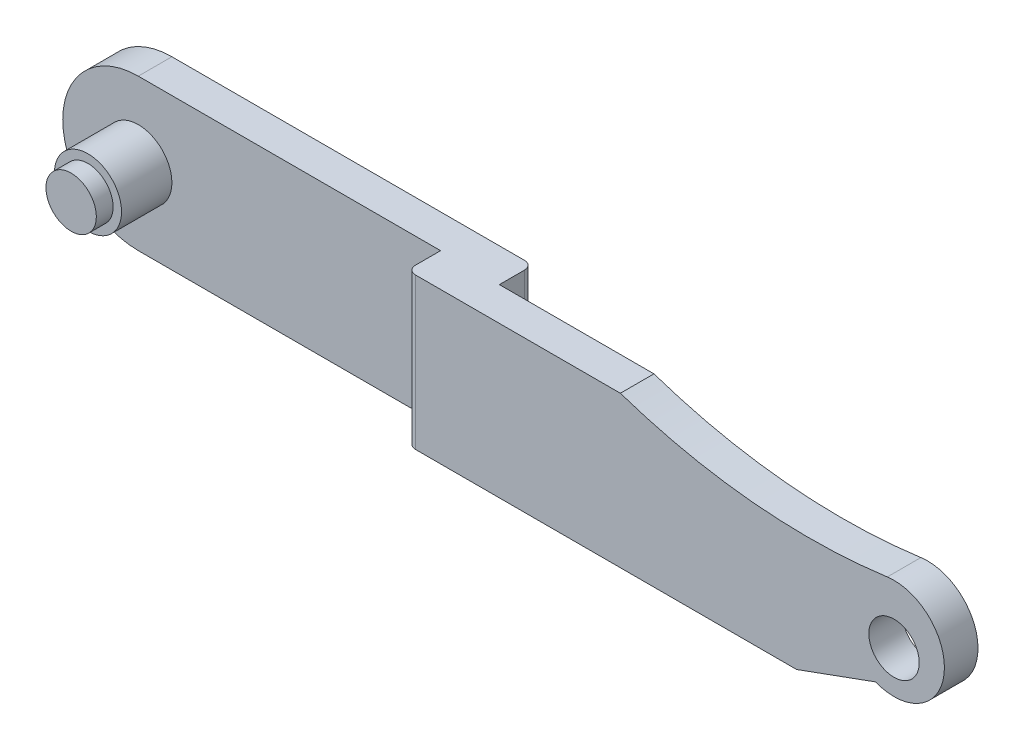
ISO-10303-21;
HEADER;
FILE_DESCRIPTION(('STEP AP214'),'2;1');
FILE_NAME('part.step','',(''),(''),'','','');
FILE_SCHEMA(('AUTOMOTIVE_DESIGN { 1 0 10303 214 1 1 1 1 }'));
ENDSEC;
DATA;
#1=APPLICATION_CONTEXT('core data for automotive mechanical design processes');
#2=APPLICATION_PROTOCOL_DEFINITION('international standard','automotive_design',2000,#1);
#3=PRODUCT_CONTEXT('',#1,'mechanical');
#4=PRODUCT('Part','Part','',(#3));
#5=PRODUCT_RELATED_PRODUCT_CATEGORY('part','',(#4));
#6=PRODUCT_DEFINITION_FORMATION('','',#4);
#7=PRODUCT_DEFINITION_CONTEXT('part definition',#1,'design');
#8=PRODUCT_DEFINITION('design','',#6,#7);
#9=PRODUCT_DEFINITION_SHAPE('','',#8);
#10=(LENGTH_UNIT() NAMED_UNIT(*) SI_UNIT(.MILLI.,.METRE.));
#11=(NAMED_UNIT(*) PLANE_ANGLE_UNIT() SI_UNIT($,.RADIAN.));
#12=(NAMED_UNIT(*) SI_UNIT($,.STERADIAN.) SOLID_ANGLE_UNIT());
#13=UNCERTAINTY_MEASURE_WITH_UNIT(LENGTH_MEASURE(1.E-05),#10,'distance_accuracy_value','');
#14=(GEOMETRIC_REPRESENTATION_CONTEXT(3) GLOBAL_UNCERTAINTY_ASSIGNED_CONTEXT((#13)) GLOBAL_UNIT_ASSIGNED_CONTEXT((#10,
#11,#12)) REPRESENTATION_CONTEXT('',''));
#15=CARTESIAN_POINT('',(0.,0.,0.));
#16=DIRECTION('',(0.,0.,1.));
#17=DIRECTION('',(1.,0.,0.));
#18=AXIS2_PLACEMENT_3D('',#15,#16,#17);
#19=CARTESIAN_POINT('',(0.,-4.5,-2.));
#20=DIRECTION('',(0.,0.,-1.));
#21=DIRECTION('',(-1.,0.,0.));
#22=AXIS2_PLACEMENT_3D('',#19,#20,#21);
#23=PLANE('',#22);
#24=CARTESIAN_POINT('',(0.,-4.5,-2.));
#25=DIRECTION('',(0.,0.,-1.));
#26=DIRECTION('',(-1.,0.,0.));
#27=AXIS2_PLACEMENT_3D('',#24,#25,#26);
#28=CIRCLE('',#27,2.);
#29=CARTESIAN_POINT('',(-2.,-4.5,-2.));
#30=VERTEX_POINT('',#29);
#31=EDGE_CURVE('E495',#30,#30,#28,.T.);
#32=ORIENTED_EDGE('',*,*,#31,.T.);
#33=EDGE_LOOP('',(#32));
#34=FACE_BOUND('',#33,.T.);
#35=CARTESIAN_POINT('',(0.,-4.5,-2.));
#36=DIRECTION('',(0.,0.,-1.));
#37=DIRECTION('',(-1.,0.,0.));
#38=AXIS2_PLACEMENT_3D('',#35,#36,#37);
#39=CIRCLE('',#38,1.5);
#40=CARTESIAN_POINT('',(-1.5,-4.5,-2.));
#41=VERTEX_POINT('',#40);
#42=EDGE_CURVE('E496',#41,#41,#39,.T.);
#43=ORIENTED_EDGE('',*,*,#42,.F.);
#44=EDGE_LOOP('',(#43));
#45=FACE_BOUND('',#44,.T.);
#46=ADVANCED_FACE('F34',(#34,#45),#23,.T.);
#47=CARTESIAN_POINT('',(0.,-4.5,0.));
#48=DIRECTION('',(0.,0.,1.));
#49=DIRECTION('',(1.,0.,0.));
#50=AXIS2_PLACEMENT_3D('',#47,#48,#49);
#51=PLANE('',#50);
#52=DIRECTION('',(-1.,0.,0.));
#53=VECTOR('',#52,1.);
#54=CARTESIAN_POINT('',(0.,0.,0.));
#55=LINE('',#54,#53);
#56=CARTESIAN_POINT('',(21.,0.,0.));
#57=VERTEX_POINT('',#56);
#58=CARTESIAN_POINT('',(0.,0.,0.));
#59=VERTEX_POINT('',#58);
#60=EDGE_CURVE('E175',#57,#59,#55,.T.);
#61=ORIENTED_EDGE('',*,*,#60,.F.);
#62=DIRECTION('',(0.,1.,0.));
#63=VECTOR('',#62,1.);
#64=CARTESIAN_POINT('',(21.,-4.5,0.));
#65=LINE('',#64,#63);
#66=CARTESIAN_POINT('',(21.,-9.,0.));
#67=VERTEX_POINT('',#66);
#68=EDGE_CURVE('E218',#57,#67,#65,.F.);
#69=ORIENTED_EDGE('',*,*,#68,.T.);
#70=DIRECTION('',(1.,0.,0.));
#71=VECTOR('',#70,1.);
#72=CARTESIAN_POINT('',(21.5,-9.,0.));
#73=LINE('',#72,#71);
#74=CARTESIAN_POINT('',(0.,-9.,0.));
#75=VERTEX_POINT('',#74);
#76=EDGE_CURVE('E173',#75,#67,#73,.T.);
#77=ORIENTED_EDGE('',*,*,#76,.F.);
#78=CARTESIAN_POINT('',(0.,-4.5,0.));
#79=DIRECTION('',(0.,0.,1.));
#80=DIRECTION('',(1.,0.,0.));
#81=AXIS2_PLACEMENT_3D('',#78,#79,#80);
#82=CIRCLE('',#81,4.5);
#83=EDGE_CURVE('E128',#59,#75,#82,.T.);
#84=ORIENTED_EDGE('',*,*,#83,.F.);
#85=EDGE_LOOP('',(#61,#69,#77,#84));
#86=FACE_BOUND('',#85,.T.);
#87=CARTESIAN_POINT('',(0.,-4.5,0.));
#88=DIRECTION('',(0.,0.,1.));
#89=DIRECTION('',(1.,0.,0.));
#90=AXIS2_PLACEMENT_3D('',#87,#88,#89);
#91=CIRCLE('',#90,2.);
#92=CARTESIAN_POINT('',(2.,-4.5,0.));
#93=VERTEX_POINT('',#92);
#94=EDGE_CURVE('E205',#93,#93,#91,.F.);
#95=ORIENTED_EDGE('',*,*,#94,.F.);
#96=EDGE_LOOP('',(#95));
#97=FACE_BOUND('',#96,.T.);
#98=ADVANCED_FACE('F279',(#86,#97),#51,.F.);
#99=CARTESIAN_POINT('',(0.,-4.5,5.));
#100=DIRECTION('',(0.,0.,1.));
#101=DIRECTION('',(1.,0.,0.));
#102=AXIS2_PLACEMENT_3D('',#99,#100,#101);
#103=PLANE('',#102);
#104=CARTESIAN_POINT('',(0.,-4.5,5.));
#105=DIRECTION('',(0.,0.,1.));
#106=DIRECTION('',(1.,0.,0.));
#107=AXIS2_PLACEMENT_3D('',#104,#105,#106);
#108=CIRCLE('',#107,2.);
#109=CARTESIAN_POINT('',(2.,-4.5,5.));
#110=VERTEX_POINT('',#109);
#111=EDGE_CURVE('E511',#110,#110,#108,.T.);
#112=ORIENTED_EDGE('',*,*,#111,.T.);
#113=EDGE_LOOP('',(#112));
#114=FACE_BOUND('',#113,.T.);
#115=CARTESIAN_POINT('',(0.,-4.5,5.));
#116=DIRECTION('',(0.,0.,1.));
#117=DIRECTION('',(1.,0.,0.));
#118=AXIS2_PLACEMENT_3D('',#115,#116,#117);
#119=CIRCLE('',#118,1.5);
#120=CARTESIAN_POINT('',(1.5,-4.5,5.));
#121=VERTEX_POINT('',#120);
#122=EDGE_CURVE('E498',#121,#121,#119,.T.);
#123=ORIENTED_EDGE('',*,*,#122,.F.);
#124=EDGE_LOOP('',(#123));
#125=FACE_BOUND('',#124,.T.);
#126=ADVANCED_FACE('F286',(#114,#125),#103,.T.);
#127=CARTESIAN_POINT('',(0.,-4.5,2.));
#128=DIRECTION('',(0.,0.,1.));
#129=DIRECTION('',(1.,0.,0.));
#130=AXIS2_PLACEMENT_3D('',#127,#128,#129);
#131=PLANE('',#130);
#132=DIRECTION('',(0.,-1.,0.));
#133=VECTOR('',#132,1.);
#134=CARTESIAN_POINT('',(18.,0.,2.));
#135=LINE('',#134,#133);
#136=CARTESIAN_POINT('',(18.,0.,2.));
#137=VERTEX_POINT('',#136);
#138=CARTESIAN_POINT('',(18.,-9.,2.));
#139=VERTEX_POINT('',#138);
#140=EDGE_CURVE('E135',#137,#139,#135,.T.);
#141=ORIENTED_EDGE('',*,*,#140,.F.);
#142=DIRECTION('',(-1.,0.,0.));
#143=VECTOR('',#142,1.);
#144=CARTESIAN_POINT('',(0.,0.,2.));
#145=LINE('',#144,#143);
#146=CARTESIAN_POINT('',(0.,0.,2.));
#147=VERTEX_POINT('',#146);
#148=EDGE_CURVE('E185',#137,#147,#145,.T.);
#149=ORIENTED_EDGE('',*,*,#148,.T.);
#150=CARTESIAN_POINT('',(0.,-4.5,2.));
#151=DIRECTION('',(0.,0.,1.));
#152=DIRECTION('',(1.,0.,0.));
#153=AXIS2_PLACEMENT_3D('',#150,#151,#152);
#154=CIRCLE('',#153,4.5);
#155=CARTESIAN_POINT('',(0.,-9.,2.));
#156=VERTEX_POINT('',#155);
#157=EDGE_CURVE('E138',#147,#156,#154,.T.);
#158=ORIENTED_EDGE('',*,*,#157,.T.);
#159=DIRECTION('',(1.,0.,0.));
#160=VECTOR('',#159,1.);
#161=CARTESIAN_POINT('',(21.5,-9.,2.));
#162=LINE('',#161,#160);
#163=EDGE_CURVE('E124',#156,#139,#162,.T.);
#164=ORIENTED_EDGE('',*,*,#163,.T.);
#165=EDGE_LOOP('',(#141,#149,#158,#164));
#166=FACE_BOUND('',#165,.T.);
#167=CARTESIAN_POINT('',(0.,-4.5,2.));
#168=DIRECTION('',(0.,0.,1.));
#169=DIRECTION('',(1.,0.,0.));
#170=AXIS2_PLACEMENT_3D('',#167,#168,#169);
#171=CIRCLE('',#170,2.);
#172=CARTESIAN_POINT('',(2.,-4.5,2.));
#173=VERTEX_POINT('',#172);
#174=EDGE_CURVE('E508',#173,#173,#171,.T.);
#175=ORIENTED_EDGE('',*,*,#174,.F.);
#176=EDGE_LOOP('',(#175));
#177=FACE_BOUND('',#176,.T.);
#178=ADVANCED_FACE('F133',(#166,#177),#131,.T.);
#179=CARTESIAN_POINT('',(0.,-4.5,2.));
#180=DIRECTION('',(0.,0.,-1.));
#181=DIRECTION('',(-1.,0.,0.));
#182=AXIS2_PLACEMENT_3D('',#179,#180,#181);
#183=CYLINDRICAL_SURFACE('',#182,4.5);
#184=ORIENTED_EDGE('',*,*,#83,.T.);
#185=DIRECTION('',(0.,0.,-1.));
#186=VECTOR('',#185,1.);
#187=CARTESIAN_POINT('',(0.,-9.,2.));
#188=LINE('',#187,#186);
#189=EDGE_CURVE('E183',#156,#75,#188,.T.);
#190=ORIENTED_EDGE('',*,*,#189,.F.);
#191=ORIENTED_EDGE('',*,*,#157,.F.);
#192=DIRECTION('',(0.,0.,-1.));
#193=VECTOR('',#192,1.);
#194=CARTESIAN_POINT('',(0.,0.,2.));
#195=LINE('',#194,#193);
#196=EDGE_CURVE('E186',#147,#59,#195,.T.);
#197=ORIENTED_EDGE('',*,*,#196,.T.);
#198=EDGE_LOOP('',(#184,#190,#191,#197));
#199=FACE_BOUND('',#198,.T.);
#200=ADVANCED_FACE('F36',(#199),#183,.T.);
#201=CARTESIAN_POINT('',(21.5,-9.,2.));
#202=DIRECTION('',(0.,1.,0.));
#203=DIRECTION('',(-1.,0.,0.));
#204=AXIS2_PLACEMENT_3D('',#201,#202,#203);
#205=PLANE('',#204);
#206=ORIENTED_EDGE('',*,*,#76,.T.);
#207=CARTESIAN_POINT('',(21.,-9.,0.5));
#208=DIRECTION('',(0.,1.,0.));
#209=DIRECTION('',(-1.,0.,0.));
#210=AXIS2_PLACEMENT_3D('',#207,#208,#209);
#211=CIRCLE('',#210,0.5);
#212=CARTESIAN_POINT('',(21.5,-9.,0.5));
#213=VERTEX_POINT('',#212);
#214=EDGE_CURVE('E221',#67,#213,#211,.F.);
#215=ORIENTED_EDGE('',*,*,#214,.T.);
#216=DIRECTION('',(0.,0.,-1.));
#217=VECTOR('',#216,1.);
#218=CARTESIAN_POINT('',(21.5,-9.,2.));
#219=LINE('',#218,#217);
#220=CARTESIAN_POINT('',(21.5,-9.,2.));
#221=VERTEX_POINT('',#220);
#222=EDGE_CURVE('E194',#221,#213,#219,.T.);
#223=ORIENTED_EDGE('',*,*,#222,.F.);
#224=DIRECTION('',(1.,0.,0.));
#225=VECTOR('',#224,1.);
#226=CARTESIAN_POINT('',(41.2,-9.,2.));
#227=LINE('',#226,#225);
#228=CARTESIAN_POINT('',(41.2,-9.,2.));
#229=VERTEX_POINT('',#228);
#230=EDGE_CURVE('E145',#221,#229,#227,.T.);
#231=ORIENTED_EDGE('',*,*,#230,.T.);
#232=DIRECTION('',(0.,0.,-1.));
#233=VECTOR('',#232,1.);
#234=CARTESIAN_POINT('',(41.2,-9.,4.));
#235=LINE('',#234,#233);
#236=CARTESIAN_POINT('',(41.2,-9.,4.));
#237=VERTEX_POINT('',#236);
#238=EDGE_CURVE('E129',#237,#229,#235,.T.);
#239=ORIENTED_EDGE('',*,*,#238,.F.);
#240=DIRECTION('',(1.,0.,0.));
#241=VECTOR('',#240,1.);
#242=CARTESIAN_POINT('',(41.2,-9.,4.));
#243=LINE('',#242,#241);
#244=CARTESIAN_POINT('',(18.5,-9.,4.));
#245=VERTEX_POINT('',#244);
#246=EDGE_CURVE('E225',#245,#237,#243,.T.);
#247=ORIENTED_EDGE('',*,*,#246,.F.);
#248=CARTESIAN_POINT('',(18.5,-9.,3.5));
#249=DIRECTION('',(0.,1.,0.));
#250=DIRECTION('',(-1.,0.,0.));
#251=AXIS2_PLACEMENT_3D('',#248,#249,#250);
#252=CIRCLE('',#251,0.5);
#253=CARTESIAN_POINT('',(18.,-9.,3.5));
#254=VERTEX_POINT('',#253);
#255=EDGE_CURVE('E49',#245,#254,#252,.F.);
#256=ORIENTED_EDGE('',*,*,#255,.T.);
#257=DIRECTION('',(0.,0.,-1.));
#258=VECTOR('',#257,1.);
#259=CARTESIAN_POINT('',(18.,-9.,4.));
#260=LINE('',#259,#258);
#261=EDGE_CURVE('E119',#254,#139,#260,.T.);
#262=ORIENTED_EDGE('',*,*,#261,.T.);
#263=ORIENTED_EDGE('',*,*,#163,.F.);
#264=ORIENTED_EDGE('',*,*,#189,.T.);
#265=EDGE_LOOP('',(#206,#215,#223,#231,#239,#247,#256,#262,#263,#264));
#266=FACE_BOUND('',#265,.T.);
#267=ADVANCED_FACE('F122',(#266),#205,.F.);
#268=CARTESIAN_POINT('',(21.5,0.,2.));
#269=DIRECTION('',(-1.,0.,0.));
#270=DIRECTION('',(0.,0.,1.));
#271=AXIS2_PLACEMENT_3D('',#268,#269,#270);
#272=PLANE('',#271);
#273=ORIENTED_EDGE('',*,*,#222,.T.);
#274=DIRECTION('',(0.,1.,0.));
#275=VECTOR('',#274,1.);
#276=CARTESIAN_POINT('',(21.5,0.,0.5));
#277=LINE('',#276,#275);
#278=CARTESIAN_POINT('',(21.5,0.,0.5));
#279=VERTEX_POINT('',#278);
#280=EDGE_CURVE('E208',#213,#279,#277,.T.);
#281=ORIENTED_EDGE('',*,*,#280,.T.);
#282=DIRECTION('',(0.,0.,-1.));
#283=VECTOR('',#282,1.);
#284=CARTESIAN_POINT('',(21.5,0.,2.));
#285=LINE('',#284,#283);
#286=CARTESIAN_POINT('',(21.5,0.,2.));
#287=VERTEX_POINT('',#286);
#288=EDGE_CURVE('E189',#287,#279,#285,.T.);
#289=ORIENTED_EDGE('',*,*,#288,.F.);
#290=DIRECTION('',(0.,1.,0.));
#291=VECTOR('',#290,1.);
#292=CARTESIAN_POINT('',(21.5,0.,2.));
#293=LINE('',#292,#291);
#294=EDGE_CURVE('E140',#221,#287,#293,.T.);
#295=ORIENTED_EDGE('',*,*,#294,.F.);
#296=EDGE_LOOP('',(#273,#281,#289,#295));
#297=FACE_BOUND('',#296,.T.);
#298=ADVANCED_FACE('F271',(#297),#272,.F.);
#299=CARTESIAN_POINT('',(0.,0.,2.));
#300=DIRECTION('',(0.,-1.,0.));
#301=DIRECTION('',(0.,0.,-1.));
#302=AXIS2_PLACEMENT_3D('',#299,#300,#301);
#303=PLANE('',#302);
#304=ORIENTED_EDGE('',*,*,#288,.T.);
#305=CARTESIAN_POINT('',(21.,0.,0.5));
#306=DIRECTION('',(0.,-1.,0.));
#307=DIRECTION('',(0.,0.,-1.));
#308=AXIS2_PLACEMENT_3D('',#305,#306,#307);
#309=CIRCLE('',#308,0.5);
#310=EDGE_CURVE('E216',#279,#57,#309,.F.);
#311=ORIENTED_EDGE('',*,*,#310,.T.);
#312=ORIENTED_EDGE('',*,*,#60,.T.);
#313=ORIENTED_EDGE('',*,*,#196,.F.);
#314=ORIENTED_EDGE('',*,*,#148,.F.);
#315=DIRECTION('',(0.,0.,-1.));
#316=VECTOR('',#315,1.);
#317=CARTESIAN_POINT('',(18.,0.,4.));
#318=LINE('',#317,#316);
#319=CARTESIAN_POINT('',(18.,0.,3.5));
#320=VERTEX_POINT('',#319);
#321=EDGE_CURVE('E144',#320,#137,#318,.T.);
#322=ORIENTED_EDGE('',*,*,#321,.F.);
#323=CARTESIAN_POINT('',(18.5,0.,3.5));
#324=DIRECTION('',(0.,-1.,0.));
#325=DIRECTION('',(0.,0.,-1.));
#326=AXIS2_PLACEMENT_3D('',#323,#324,#325);
#327=CIRCLE('',#326,0.5);
#328=CARTESIAN_POINT('',(18.5,0.,4.));
#329=VERTEX_POINT('',#328);
#330=EDGE_CURVE('E211',#320,#329,#327,.F.);
#331=ORIENTED_EDGE('',*,*,#330,.T.);
#332=DIRECTION('',(-1.,0.,0.));
#333=VECTOR('',#332,1.);
#334=CARTESIAN_POINT('',(18.,0.,4.));
#335=LINE('',#334,#333);
#336=CARTESIAN_POINT('',(30.7039235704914,0.,4.));
#337=VERTEX_POINT('',#336);
#338=EDGE_CURVE('E214',#337,#329,#335,.T.);
#339=ORIENTED_EDGE('',*,*,#338,.F.);
#340=DIRECTION('',(0.,0.,-1.));
#341=VECTOR('',#340,1.);
#342=CARTESIAN_POINT('',(30.7039235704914,0.,4.));
#343=LINE('',#342,#341);
#344=CARTESIAN_POINT('',(30.7039235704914,0.,2.));
#345=VERTEX_POINT('',#344);
#346=EDGE_CURVE('E213',#337,#345,#343,.T.);
#347=ORIENTED_EDGE('',*,*,#346,.T.);
#348=DIRECTION('',(-1.,0.,0.));
#349=VECTOR('',#348,1.);
#350=CARTESIAN_POINT('',(18.,0.,2.));
#351=LINE('',#350,#349);
#352=EDGE_CURVE('E168',#345,#287,#351,.T.);
#353=ORIENTED_EDGE('',*,*,#352,.T.);
#354=EDGE_LOOP('',(#304,#311,#312,#313,#314,#322,#331,#339,#347,#353));
#355=FACE_BOUND('',#354,.T.);
#356=ADVANCED_FACE('F268',(#355),#303,.F.);
#357=CARTESIAN_POINT('',(47.,-4.5,2.));
#358=DIRECTION('',(0.,0.,1.));
#359=DIRECTION('',(1.,0.,0.));
#360=AXIS2_PLACEMENT_3D('',#357,#358,#359);
#361=PLANE('',#360);
#362=CARTESIAN_POINT('',(47.,-4.99999999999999,2.));
#363=DIRECTION('',(0.,0.,1.));
#364=DIRECTION('',(1.,0.,0.));
#365=AXIS2_PLACEMENT_3D('',#362,#363,#364);
#366=CIRCLE('',#365,1.5);
#367=CARTESIAN_POINT('',(48.5,-4.99999999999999,2.));
#368=VERTEX_POINT('',#367);
#369=EDGE_CURVE('E146',#368,#368,#366,.T.);
#370=ORIENTED_EDGE('',*,*,#369,.T.);
#371=EDGE_LOOP('',(#370));
#372=FACE_BOUND('',#371,.T.);
#373=ORIENTED_EDGE('',*,*,#230,.F.);
#374=ORIENTED_EDGE('',*,*,#294,.T.);
#375=ORIENTED_EDGE('',*,*,#352,.F.);
#376=CARTESIAN_POINT('',(41.91,33.1575609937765,2.));
#377=DIRECTION('',(0.,0.,-1.));
#378=DIRECTION('',(1.,0.,0.));
#379=AXIS2_PLACEMENT_3D('',#376,#377,#378);
#380=CIRCLE('',#379,35.);
#381=CARTESIAN_POINT('',(46.5981578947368,-1.52703465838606,2.));
#382=VERTEX_POINT('',#381);
#383=EDGE_CURVE('E235',#382,#345,#380,.T.);
#384=ORIENTED_EDGE('',*,*,#383,.F.);
#385=CARTESIAN_POINT('',(47.,-4.5,2.));
#386=DIRECTION('',(0.,0.,1.));
#387=DIRECTION('',(1.,0.,0.));
#388=AXIS2_PLACEMENT_3D('',#385,#386,#387);
#389=CIRCLE('',#388,3.);
#390=CARTESIAN_POINT('',(45.8977361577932,-7.29016387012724,2.));
#391=VERTEX_POINT('',#390);
#392=EDGE_CURVE('E260',#391,#382,#389,.T.);
#393=ORIENTED_EDGE('',*,*,#392,.F.);
#394=DIRECTION('',(0.93969262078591,0.342020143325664,0.));
#395=VECTOR('',#394,1.);
#396=CARTESIAN_POINT('',(41.2,-9.,2.));
#397=LINE('',#396,#395);
#398=EDGE_CURVE('E148',#229,#391,#397,.T.);
#399=ORIENTED_EDGE('',*,*,#398,.F.);
#400=EDGE_LOOP('',(#373,#374,#375,#384,#393,#399));
#401=FACE_BOUND('',#400,.T.);
#402=ADVANCED_FACE('F257',(#372,#401),#361,.F.);
#403=CARTESIAN_POINT('',(18.,0.,4.));
#404=DIRECTION('',(1.,0.,0.));
#405=DIRECTION('',(0.,0.,-1.));
#406=AXIS2_PLACEMENT_3D('',#403,#404,#405);
#407=PLANE('',#406);
#408=ORIENTED_EDGE('',*,*,#261,.F.);
#409=DIRECTION('',(0.,-1.,0.));
#410=VECTOR('',#409,1.);
#411=CARTESIAN_POINT('',(18.,0.,3.5));
#412=LINE('',#411,#410);
#413=EDGE_CURVE('E11',#254,#320,#412,.F.);
#414=ORIENTED_EDGE('',*,*,#413,.T.);
#415=ORIENTED_EDGE('',*,*,#321,.T.);
#416=ORIENTED_EDGE('',*,*,#140,.T.);
#417=EDGE_LOOP('',(#408,#414,#415,#416));
#418=FACE_BOUND('',#417,.T.);
#419=ADVANCED_FACE('F142',(#418),#407,.F.);
#420=CARTESIAN_POINT('',(41.2,-9.,4.));
#421=DIRECTION('',(-0.342020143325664,0.93969262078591,0.));
#422=DIRECTION('',(-0.93969262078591,-0.342020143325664,0.));
#423=AXIS2_PLACEMENT_3D('',#420,#421,#422);
#424=PLANE('',#423);
#425=ORIENTED_EDGE('',*,*,#398,.T.);
#426=DIRECTION('',(0.,0.,-1.));
#427=VECTOR('',#426,1.);
#428=CARTESIAN_POINT('',(45.8977361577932,-7.29016387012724,4.));
#429=LINE('',#428,#427);
#430=CARTESIAN_POINT('',(45.8977361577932,-7.29016387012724,4.));
#431=VERTEX_POINT('',#430);
#432=EDGE_CURVE('E248',#431,#391,#429,.T.);
#433=ORIENTED_EDGE('',*,*,#432,.F.);
#434=DIRECTION('',(0.93969262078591,0.342020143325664,0.));
#435=VECTOR('',#434,1.);
#436=CARTESIAN_POINT('',(41.2,-9.,4.));
#437=LINE('',#436,#435);
#438=EDGE_CURVE('E231',#237,#431,#437,.T.);
#439=ORIENTED_EDGE('',*,*,#438,.F.);
#440=ORIENTED_EDGE('',*,*,#238,.T.);
#441=EDGE_LOOP('',(#425,#433,#439,#440));
#442=FACE_BOUND('',#441,.T.);
#443=ADVANCED_FACE('F252',(#442),#424,.F.);
#444=CARTESIAN_POINT('',(47.,-4.5,4.));
#445=DIRECTION('',(0.,0.,-1.));
#446=DIRECTION('',(-1.,0.,0.));
#447=AXIS2_PLACEMENT_3D('',#444,#445,#446);
#448=CYLINDRICAL_SURFACE('',#447,3.);
#449=ORIENTED_EDGE('',*,*,#392,.T.);
#450=DIRECTION('',(0.,0.,-1.));
#451=VECTOR('',#450,1.);
#452=CARTESIAN_POINT('',(46.5981578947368,-1.52703465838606,4.));
#453=LINE('',#452,#451);
#454=CARTESIAN_POINT('',(46.5981578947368,-1.52703465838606,4.));
#455=VERTEX_POINT('',#454);
#456=EDGE_CURVE('E245',#455,#382,#453,.T.);
#457=ORIENTED_EDGE('',*,*,#456,.F.);
#458=CARTESIAN_POINT('',(47.,-4.5,4.));
#459=DIRECTION('',(0.,0.,1.));
#460=DIRECTION('',(1.,0.,0.));
#461=AXIS2_PLACEMENT_3D('',#458,#459,#460);
#462=CIRCLE('',#461,3.);
#463=EDGE_CURVE('E233',#431,#455,#462,.T.);
#464=ORIENTED_EDGE('',*,*,#463,.F.);
#465=ORIENTED_EDGE('',*,*,#432,.T.);
#466=EDGE_LOOP('',(#449,#457,#464,#465));
#467=FACE_BOUND('',#466,.T.);
#468=ADVANCED_FACE('F332',(#467),#448,.T.);
#469=CARTESIAN_POINT('',(41.91,33.1575609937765,4.));
#470=DIRECTION('',(0.,0.,-1.));
#471=DIRECTION('',(-1.,0.,0.));
#472=AXIS2_PLACEMENT_3D('',#469,#470,#471);
#473=CYLINDRICAL_SURFACE('',#472,35.);
#474=ORIENTED_EDGE('',*,*,#383,.T.);
#475=ORIENTED_EDGE('',*,*,#346,.F.);
#476=CARTESIAN_POINT('',(41.91,33.1575609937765,4.));
#477=DIRECTION('',(0.,0.,-1.));
#478=DIRECTION('',(1.,0.,0.));
#479=AXIS2_PLACEMENT_3D('',#476,#477,#478);
#480=CIRCLE('',#479,35.);
#481=EDGE_CURVE('E240',#455,#337,#480,.T.);
#482=ORIENTED_EDGE('',*,*,#481,.F.);
#483=ORIENTED_EDGE('',*,*,#456,.T.);
#484=EDGE_LOOP('',(#474,#475,#482,#483));
#485=FACE_BOUND('',#484,.T.);
#486=ADVANCED_FACE('F265',(#485),#473,.F.);
#487=CARTESIAN_POINT('',(47.,-4.5,4.));
#488=DIRECTION('',(0.,0.,1.));
#489=DIRECTION('',(1.,0.,0.));
#490=AXIS2_PLACEMENT_3D('',#487,#488,#489);
#491=PLANE('',#490);
#492=CARTESIAN_POINT('',(47.,-4.99999999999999,4.));
#493=DIRECTION('',(0.,0.,1.));
#494=DIRECTION('',(1.,0.,0.));
#495=AXIS2_PLACEMENT_3D('',#492,#493,#494);
#496=CIRCLE('',#495,1.5);
#497=CARTESIAN_POINT('',(48.5,-4.99999999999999,4.));
#498=VERTEX_POINT('',#497);
#499=EDGE_CURVE('E151',#498,#498,#496,.T.);
#500=ORIENTED_EDGE('',*,*,#499,.F.);
#501=EDGE_LOOP('',(#500));
#502=FACE_BOUND('',#501,.T.);
#503=ORIENTED_EDGE('',*,*,#338,.T.);
#504=DIRECTION('',(0.,-1.,0.));
#505=VECTOR('',#504,1.);
#506=CARTESIAN_POINT('',(18.5,-9.,4.));
#507=LINE('',#506,#505);
#508=EDGE_CURVE('E42',#329,#245,#507,.T.);
#509=ORIENTED_EDGE('',*,*,#508,.T.);
#510=ORIENTED_EDGE('',*,*,#246,.T.);
#511=ORIENTED_EDGE('',*,*,#438,.T.);
#512=ORIENTED_EDGE('',*,*,#463,.T.);
#513=ORIENTED_EDGE('',*,*,#481,.T.);
#514=EDGE_LOOP('',(#503,#509,#510,#511,#512,#513));
#515=FACE_BOUND('',#514,.T.);
#516=ADVANCED_FACE('F224',(#502,#515),#491,.T.);
#517=CARTESIAN_POINT('',(47.,-4.99999999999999,-2.49999999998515E-05));
#518=DIRECTION('',(0.,0.,1.));
#519=DIRECTION('',(1.,0.,0.));
#520=AXIS2_PLACEMENT_3D('',#517,#518,#519);
#521=CYLINDRICAL_SURFACE('',#520,1.5);
#522=ORIENTED_EDGE('',*,*,#499,.T.);
#523=EDGE_LOOP('',(#522));
#524=FACE_BOUND('',#523,.T.);
#525=ORIENTED_EDGE('',*,*,#369,.F.);
#526=EDGE_LOOP('',(#525));
#527=FACE_BOUND('',#526,.T.);
#528=ADVANCED_FACE('F319',(#524,#527),#521,.F.);
#529=CARTESIAN_POINT('',(0.,-4.5,5.));
#530=DIRECTION('',(0.,0.,-1.));
#531=DIRECTION('',(-1.,0.,0.));
#532=AXIS2_PLACEMENT_3D('',#529,#530,#531);
#533=CYLINDRICAL_SURFACE('',#532,2.);
#534=ORIENTED_EDGE('',*,*,#111,.F.);
#535=EDGE_LOOP('',(#534));
#536=FACE_BOUND('',#535,.T.);
#537=ORIENTED_EDGE('',*,*,#174,.T.);
#538=EDGE_LOOP('',(#537));
#539=FACE_BOUND('',#538,.T.);
#540=ADVANCED_FACE('F312',(#536,#539),#533,.T.);
#541=CARTESIAN_POINT('',(0.,-4.5,6.));
#542=DIRECTION('',(0.,0.,-1.));
#543=DIRECTION('',(-1.,0.,0.));
#544=AXIS2_PLACEMENT_3D('',#541,#542,#543);
#545=CYLINDRICAL_SURFACE('',#544,1.5);
#546=CARTESIAN_POINT('',(0.,-4.5,6.));
#547=DIRECTION('',(0.,0.,1.));
#548=DIRECTION('',(1.,0.,0.));
#549=AXIS2_PLACEMENT_3D('',#546,#547,#548);
#550=CIRCLE('',#549,1.5);
#551=CARTESIAN_POINT('',(1.5,-4.5,6.));
#552=VERTEX_POINT('',#551);
#553=EDGE_CURVE('E505',#552,#552,#550,.T.);
#554=ORIENTED_EDGE('',*,*,#553,.F.);
#555=EDGE_LOOP('',(#554));
#556=FACE_BOUND('',#555,.T.);
#557=ORIENTED_EDGE('',*,*,#122,.T.);
#558=EDGE_LOOP('',(#557));
#559=FACE_BOUND('',#558,.T.);
#560=ADVANCED_FACE('F308',(#556,#559),#545,.T.);
#561=CARTESIAN_POINT('',(0.,-4.5,6.));
#562=DIRECTION('',(0.,0.,1.));
#563=DIRECTION('',(1.,0.,0.));
#564=AXIS2_PLACEMENT_3D('',#561,#562,#563);
#565=PLANE('',#564);
#566=ORIENTED_EDGE('',*,*,#553,.T.);
#567=EDGE_LOOP('',(#566));
#568=FACE_BOUND('',#567,.T.);
#569=ADVANCED_FACE('F304',(#568),#565,.T.);
#570=CARTESIAN_POINT('',(0.,-4.5,-2.));
#571=DIRECTION('',(0.,0.,1.));
#572=DIRECTION('',(1.,0.,0.));
#573=AXIS2_PLACEMENT_3D('',#570,#571,#572);
#574=CYLINDRICAL_SURFACE('',#573,2.);
#575=ORIENTED_EDGE('',*,*,#31,.F.);
#576=EDGE_LOOP('',(#575));
#577=FACE_BOUND('',#576,.T.);
#578=ORIENTED_EDGE('',*,*,#94,.T.);
#579=EDGE_LOOP('',(#578));
#580=FACE_BOUND('',#579,.T.);
#581=ADVANCED_FACE('F301',(#577,#580),#574,.T.);
#582=CARTESIAN_POINT('',(0.,-4.5,-3.));
#583=DIRECTION('',(0.,0.,1.));
#584=DIRECTION('',(1.,0.,0.));
#585=AXIS2_PLACEMENT_3D('',#582,#583,#584);
#586=CYLINDRICAL_SURFACE('',#585,1.5);
#587=CARTESIAN_POINT('',(0.,-4.5,-3.));
#588=DIRECTION('',(0.,0.,-1.));
#589=DIRECTION('',(-1.,0.,0.));
#590=AXIS2_PLACEMENT_3D('',#587,#588,#589);
#591=CIRCLE('',#590,1.5);
#592=CARTESIAN_POINT('',(-1.5,-4.5,-3.));
#593=VERTEX_POINT('',#592);
#594=EDGE_CURVE('E494',#593,#593,#591,.T.);
#595=ORIENTED_EDGE('',*,*,#594,.F.);
#596=EDGE_LOOP('',(#595));
#597=FACE_BOUND('',#596,.T.);
#598=ORIENTED_EDGE('',*,*,#42,.T.);
#599=EDGE_LOOP('',(#598));
#600=FACE_BOUND('',#599,.T.);
#601=ADVANCED_FACE('F299',(#597,#600),#586,.T.);
#602=CARTESIAN_POINT('',(0.,-4.5,-3.));
#603=DIRECTION('',(0.,0.,-1.));
#604=DIRECTION('',(-1.,0.,0.));
#605=AXIS2_PLACEMENT_3D('',#602,#603,#604);
#606=PLANE('',#605);
#607=ORIENTED_EDGE('',*,*,#594,.T.);
#608=EDGE_LOOP('',(#607));
#609=FACE_BOUND('',#608,.T.);
#610=ADVANCED_FACE('F403',(#609),#606,.T.);
#611=CARTESIAN_POINT('',(21.,0.,0.5));
#612=DIRECTION('',(0.,1.,0.));
#613=DIRECTION('',(0.,0.,1.));
#614=AXIS2_PLACEMENT_3D('',#611,#612,#613);
#615=CYLINDRICAL_SURFACE('',#614,0.5);
#616=ORIENTED_EDGE('',*,*,#214,.F.);
#617=ORIENTED_EDGE('',*,*,#68,.F.);
#618=ORIENTED_EDGE('',*,*,#310,.F.);
#619=ORIENTED_EDGE('',*,*,#280,.F.);
#620=EDGE_LOOP('',(#616,#617,#618,#619));
#621=FACE_BOUND('',#620,.T.);
#622=ADVANCED_FACE('F275',(#621),#615,.T.);
#623=CARTESIAN_POINT('',(18.5,-4.5,3.5));
#624=DIRECTION('',(0.,1.,0.));
#625=DIRECTION('',(0.,0.,1.));
#626=AXIS2_PLACEMENT_3D('',#623,#624,#625);
#627=CYLINDRICAL_SURFACE('',#626,0.5);
#628=ORIENTED_EDGE('',*,*,#330,.F.);
#629=ORIENTED_EDGE('',*,*,#413,.F.);
#630=ORIENTED_EDGE('',*,*,#255,.F.);
#631=ORIENTED_EDGE('',*,*,#508,.F.);
#632=EDGE_LOOP('',(#628,#629,#630,#631));
#633=FACE_BOUND('',#632,.T.);
#634=ADVANCED_FACE('F416',(#633),#627,.T.);
#635=CLOSED_SHELL('',(#46,#98,#126,#178,#200,#267,#298,#356,#402,#419,#443,#468,#486,#516,#528,
#540,#560,#569,#581,#601,#610,#622,#634));
#636=MANIFOLD_SOLID_BREP('B2',#635);
#637=ADVANCED_BREP_SHAPE_REPRESENTATION('',(#18,#636),#14);
#638=SHAPE_DEFINITION_REPRESENTATION(#9,#637);
ENDSEC;
END-ISO-10303-21;
